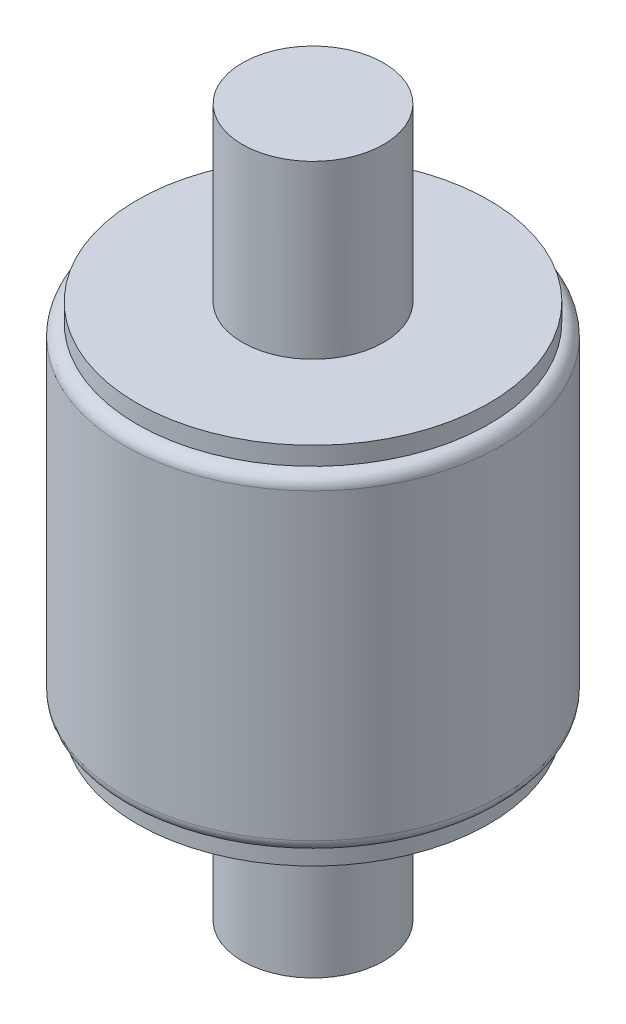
ISO-10303-21;
HEADER;
FILE_DESCRIPTION(('STEP AP214'),'2;1');
FILE_NAME('part.step','',(''),(''),'','','');
FILE_SCHEMA(('AUTOMOTIVE_DESIGN { 1 0 10303 214 1 1 1 1 }'));
ENDSEC;
DATA;
#1=APPLICATION_CONTEXT('core data for automotive mechanical design processes');
#2=APPLICATION_PROTOCOL_DEFINITION('international standard','automotive_design',2000,#1);
#3=PRODUCT_CONTEXT('',#1,'mechanical');
#4=PRODUCT('Part','Part','',(#3));
#5=PRODUCT_RELATED_PRODUCT_CATEGORY('part','',(#4));
#6=PRODUCT_DEFINITION_FORMATION('','',#4);
#7=PRODUCT_DEFINITION_CONTEXT('part definition',#1,'design');
#8=PRODUCT_DEFINITION('design','',#6,#7);
#9=PRODUCT_DEFINITION_SHAPE('','',#8);
#10=(LENGTH_UNIT() NAMED_UNIT(*) SI_UNIT(.MILLI.,.METRE.));
#11=(NAMED_UNIT(*) PLANE_ANGLE_UNIT() SI_UNIT($,.RADIAN.));
#12=(NAMED_UNIT(*) SI_UNIT($,.STERADIAN.) SOLID_ANGLE_UNIT());
#13=UNCERTAINTY_MEASURE_WITH_UNIT(LENGTH_MEASURE(1.E-05),#10,'distance_accuracy_value','');
#14=(GEOMETRIC_REPRESENTATION_CONTEXT(3) GLOBAL_UNCERTAINTY_ASSIGNED_CONTEXT((#13)) GLOBAL_UNIT_ASSIGNED_CONTEXT((#10,
#11,#12)) REPRESENTATION_CONTEXT('',''));
#15=CARTESIAN_POINT('',(0.,0.,0.));
#16=DIRECTION('',(0.,0.,1.));
#17=DIRECTION('',(1.,0.,0.));
#18=AXIS2_PLACEMENT_3D('',#15,#16,#17);
#19=CARTESIAN_POINT('',(-53.2853652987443,43.1558230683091,0.));
#20=DIRECTION('',(0.,-1.,0.));
#21=DIRECTION('',(0.,0.,-1.));
#22=AXIS2_PLACEMENT_3D('',#19,#20,#21);
#23=PLANE('',#22);
#24=CARTESIAN_POINT('',(-53.2853652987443,43.1558230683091,0.));
#25=DIRECTION('',(0.,-1.,0.));
#26=DIRECTION('',(0.,0.,-1.));
#27=AXIS2_PLACEMENT_3D('',#24,#25,#26);
#28=CIRCLE('',#27,2.269);
#29=CARTESIAN_POINT('',(-53.2853652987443,43.1558230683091,-2.269));
#30=VERTEX_POINT('',#29);
#31=EDGE_CURVE('E54',#30,#30,#28,.T.);
#32=ORIENTED_EDGE('',*,*,#31,.T.);
#33=EDGE_LOOP('',(#32));
#34=FACE_BOUND('',#33,.T.);
#35=CARTESIAN_POINT('',(-53.2853652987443,43.1558230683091,0.));
#36=DIRECTION('',(0.,1.,0.));
#37=DIRECTION('',(0.,0.,1.));
#38=AXIS2_PLACEMENT_3D('',#35,#36,#37);
#39=CIRCLE('',#38,5.65);
#40=CARTESIAN_POINT('',(-53.2853652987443,43.1558230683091,5.65));
#41=VERTEX_POINT('',#40);
#42=EDGE_CURVE('E10',#41,#41,#39,.T.);
#43=ORIENTED_EDGE('',*,*,#42,.T.);
#44=EDGE_LOOP('',(#43));
#45=FACE_BOUND('',#44,.T.);
#46=ADVANCED_FACE('F29',(#34,#45),#23,.F.);
#47=CARTESIAN_POINT('',(-53.2853652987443,43.1558230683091,0.));
#48=DIRECTION('',(0.,1.,0.));
#49=DIRECTION('',(0.,0.,1.));
#50=AXIS2_PLACEMENT_3D('',#47,#48,#49);
#51=CYLINDRICAL_SURFACE('',#50,5.65);
#52=ORIENTED_EDGE('',*,*,#42,.F.);
#53=EDGE_LOOP('',(#52));
#54=FACE_BOUND('',#53,.T.);
#55=CARTESIAN_POINT('',(-53.2853652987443,42.5708230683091,0.));
#56=DIRECTION('',(0.,1.,0.));
#57=DIRECTION('',(0.,0.,1.));
#58=AXIS2_PLACEMENT_3D('',#55,#56,#57);
#59=CIRCLE('',#58,5.65);
#60=CARTESIAN_POINT('',(-53.2853652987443,42.5708230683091,5.65));
#61=VERTEX_POINT('',#60);
#62=EDGE_CURVE('E36',#61,#61,#59,.T.);
#63=ORIENTED_EDGE('',*,*,#62,.T.);
#64=EDGE_LOOP('',(#63));
#65=FACE_BOUND('',#64,.T.);
#66=ADVANCED_FACE('F74',(#54,#65),#51,.T.);
#67=CARTESIAN_POINT('',(-53.2853652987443,42.1708230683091,0.));
#68=DIRECTION('',(0.,1.,0.));
#69=DIRECTION('',(0.,0.,1.));
#70=AXIS2_PLACEMENT_3D('',#67,#68,#69);
#71=TOROIDAL_SURFACE('',#70,5.65,0.400000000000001);
#72=ORIENTED_EDGE('',*,*,#62,.F.);
#73=EDGE_LOOP('',(#72));
#74=FACE_BOUND('',#73,.T.);
#75=CARTESIAN_POINT('',(-53.2853652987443,42.1708230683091,0.));
#76=DIRECTION('',(0.,1.,0.));
#77=DIRECTION('',(0.,0.,1.));
#78=AXIS2_PLACEMENT_3D('',#75,#76,#77);
#79=CIRCLE('',#78,6.05);
#80=CARTESIAN_POINT('',(-53.2853652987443,42.1708230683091,6.05));
#81=VERTEX_POINT('',#80);
#82=EDGE_CURVE('E40',#81,#81,#79,.T.);
#83=ORIENTED_EDGE('',*,*,#82,.T.);
#84=EDGE_LOOP('',(#83));
#85=FACE_BOUND('',#84,.T.);
#86=ADVANCED_FACE('F78',(#74,#85),#71,.T.);
#87=CARTESIAN_POINT('',(-53.2853652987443,43.1558230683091,0.));
#88=DIRECTION('',(0.,1.,0.));
#89=DIRECTION('',(0.,0.,1.));
#90=AXIS2_PLACEMENT_3D('',#87,#88,#89);
#91=CYLINDRICAL_SURFACE('',#90,6.05);
#92=ORIENTED_EDGE('',*,*,#82,.F.);
#93=EDGE_LOOP('',(#92));
#94=FACE_BOUND('',#93,.T.);
#95=CARTESIAN_POINT('',(-53.2853652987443,32.4408230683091,0.));
#96=DIRECTION('',(0.,1.,0.));
#97=DIRECTION('',(0.,0.,1.));
#98=AXIS2_PLACEMENT_3D('',#95,#96,#97);
#99=CIRCLE('',#98,6.05);
#100=CARTESIAN_POINT('',(-53.2853652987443,32.4408230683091,6.05));
#101=VERTEX_POINT('',#100);
#102=EDGE_CURVE('E45',#101,#101,#99,.T.);
#103=ORIENTED_EDGE('',*,*,#102,.T.);
#104=EDGE_LOOP('',(#103));
#105=FACE_BOUND('',#104,.T.);
#106=ADVANCED_FACE('F83',(#94,#105),#91,.T.);
#107=CARTESIAN_POINT('',(-53.2853652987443,32.4408230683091,0.));
#108=DIRECTION('',(0.,1.,0.));
#109=DIRECTION('',(0.,0.,1.));
#110=AXIS2_PLACEMENT_3D('',#107,#108,#109);
#111=TOROIDAL_SURFACE('',#110,5.65,0.400000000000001);
#112=ORIENTED_EDGE('',*,*,#102,.F.);
#113=EDGE_LOOP('',(#112));
#114=FACE_BOUND('',#113,.T.);
#115=CARTESIAN_POINT('',(-53.2853652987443,32.0408230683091,0.));
#116=DIRECTION('',(0.,1.,0.));
#117=DIRECTION('',(0.,0.,1.));
#118=AXIS2_PLACEMENT_3D('',#115,#116,#117);
#119=CIRCLE('',#118,5.65);
#120=CARTESIAN_POINT('',(-53.2853652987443,32.0408230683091,5.65));
#121=VERTEX_POINT('',#120);
#122=EDGE_CURVE('E48',#121,#121,#119,.T.);
#123=ORIENTED_EDGE('',*,*,#122,.T.);
#124=EDGE_LOOP('',(#123));
#125=FACE_BOUND('',#124,.T.);
#126=ADVANCED_FACE('F90',(#114,#125),#111,.T.);
#127=CARTESIAN_POINT('',(-53.2853652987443,43.1558230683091,0.));
#128=DIRECTION('',(0.,1.,0.));
#129=DIRECTION('',(0.,0.,1.));
#130=AXIS2_PLACEMENT_3D('',#127,#128,#129);
#131=CYLINDRICAL_SURFACE('',#130,5.65);
#132=ORIENTED_EDGE('',*,*,#122,.F.);
#133=EDGE_LOOP('',(#132));
#134=FACE_BOUND('',#133,.T.);
#135=CARTESIAN_POINT('',(-53.2853652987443,31.4558230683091,0.));
#136=DIRECTION('',(0.,1.,0.));
#137=DIRECTION('',(0.,0.,1.));
#138=AXIS2_PLACEMENT_3D('',#135,#136,#137);
#139=CIRCLE('',#138,5.65);
#140=CARTESIAN_POINT('',(-53.2853652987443,31.4558230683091,5.65));
#141=VERTEX_POINT('',#140);
#142=EDGE_CURVE('E51',#141,#141,#139,.T.);
#143=ORIENTED_EDGE('',*,*,#142,.T.);
#144=EDGE_LOOP('',(#143));
#145=FACE_BOUND('',#144,.T.);
#146=ADVANCED_FACE('F94',(#134,#145),#131,.T.);
#147=CARTESIAN_POINT('',(-53.2853652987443,31.4558230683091,0.));
#148=DIRECTION('',(0.,1.,0.));
#149=DIRECTION('',(0.,0.,1.));
#150=AXIS2_PLACEMENT_3D('',#147,#148,#149);
#151=PLANE('',#150);
#152=CARTESIAN_POINT('',(-53.2853652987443,31.4558230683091,0.));
#153=DIRECTION('',(0.,1.,0.));
#154=DIRECTION('',(0.,0.,1.));
#155=AXIS2_PLACEMENT_3D('',#152,#153,#154);
#156=CIRCLE('',#155,2.269);
#157=CARTESIAN_POINT('',(-53.2853652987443,31.4558230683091,2.269));
#158=VERTEX_POINT('',#157);
#159=EDGE_CURVE('E32',#158,#158,#156,.T.);
#160=ORIENTED_EDGE('',*,*,#159,.T.);
#161=EDGE_LOOP('',(#160));
#162=FACE_BOUND('',#161,.T.);
#163=ORIENTED_EDGE('',*,*,#142,.F.);
#164=EDGE_LOOP('',(#163));
#165=FACE_BOUND('',#164,.T.);
#166=ADVANCED_FACE('F98',(#162,#165),#151,.F.);
#167=CARTESIAN_POINT('',(-53.2853652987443,25.9508230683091,0.));
#168=DIRECTION('',(0.,1.,0.));
#169=DIRECTION('',(0.,0.,1.));
#170=AXIS2_PLACEMENT_3D('',#167,#168,#169);
#171=PLANE('',#170);
#172=CARTESIAN_POINT('',(-53.2853652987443,25.9508230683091,0.));
#173=DIRECTION('',(0.,1.,0.));
#174=DIRECTION('',(0.,0.,1.));
#175=AXIS2_PLACEMENT_3D('',#172,#173,#174);
#176=CIRCLE('',#175,2.269);
#177=CARTESIAN_POINT('',(-53.2853652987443,25.9508230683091,2.269));
#178=VERTEX_POINT('',#177);
#179=EDGE_CURVE('E57',#178,#178,#176,.T.);
#180=ORIENTED_EDGE('',*,*,#179,.F.);
#181=EDGE_LOOP('',(#180));
#182=FACE_BOUND('',#181,.T.);
#183=ADVANCED_FACE('F101',(#182),#171,.F.);
#184=CARTESIAN_POINT('',(-53.2853652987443,25.9508230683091,0.));
#185=DIRECTION('',(0.,1.,0.));
#186=DIRECTION('',(0.,0.,1.));
#187=AXIS2_PLACEMENT_3D('',#184,#185,#186);
#188=CYLINDRICAL_SURFACE('',#187,2.269);
#189=ORIENTED_EDGE('',*,*,#179,.T.);
#190=EDGE_LOOP('',(#189));
#191=FACE_BOUND('',#190,.T.);
#192=ORIENTED_EDGE('',*,*,#159,.F.);
#193=EDGE_LOOP('',(#192));
#194=FACE_BOUND('',#193,.T.);
#195=ADVANCED_FACE('F69',(#191,#194),#188,.T.);
#196=CARTESIAN_POINT('',(-53.2853652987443,48.6608230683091,0.));
#197=DIRECTION('',(0.,1.,0.));
#198=DIRECTION('',(0.,0.,1.));
#199=AXIS2_PLACEMENT_3D('',#196,#197,#198);
#200=CIRCLE('',#199,2.269);
#201=CARTESIAN_POINT('',(-53.2853652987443,48.6608230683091,2.269));
#202=VERTEX_POINT('',#201);
#203=EDGE_CURVE('E60',#202,#202,#200,.T.);
#204=ORIENTED_EDGE('',*,*,#203,.F.);
#205=EDGE_LOOP('',(#204));
#206=FACE_BOUND('',#205,.T.);
#207=ORIENTED_EDGE('',*,*,#31,.F.);
#208=EDGE_LOOP('',(#207));
#209=FACE_BOUND('',#208,.T.);
#210=ADVANCED_FACE('F66',(#206,#209),#188,.T.);
#211=CARTESIAN_POINT('',(-53.2853652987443,48.6608230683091,0.));
#212=DIRECTION('',(0.,1.,0.));
#213=DIRECTION('',(0.,0.,1.));
#214=AXIS2_PLACEMENT_3D('',#211,#212,#213);
#215=PLANE('',#214);
#216=ORIENTED_EDGE('',*,*,#203,.T.);
#217=EDGE_LOOP('',(#216));
#218=FACE_BOUND('',#217,.T.);
#219=ADVANCED_FACE('F64',(#218),#215,.T.);
#220=CLOSED_SHELL('',(#46,#66,#86,#106,#126,#146,#166,#183,#195,#210,#219));
#221=MANIFOLD_SOLID_BREP('B2',#220);
#222=ADVANCED_BREP_SHAPE_REPRESENTATION('',(#18,#221),#14);
#223=SHAPE_DEFINITION_REPRESENTATION(#9,#222);
ENDSEC;
END-ISO-10303-21;
